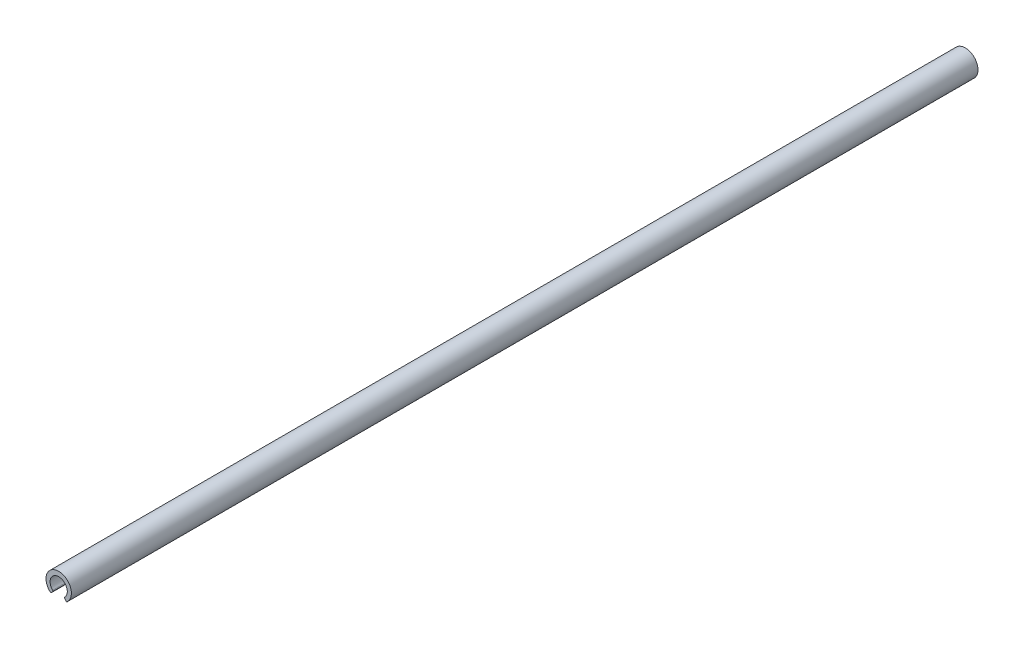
ISO-10303-21;
HEADER;
FILE_DESCRIPTION(('STEP AP214'),'2;1');
FILE_NAME('part.step','',(''),(''),'','','');
FILE_SCHEMA(('AUTOMOTIVE_DESIGN { 1 0 10303 214 1 1 1 1 }'));
ENDSEC;
DATA;
#1=APPLICATION_CONTEXT('core data for automotive mechanical design processes');
#2=APPLICATION_PROTOCOL_DEFINITION('international standard','automotive_design',2000,#1);
#3=PRODUCT_CONTEXT('',#1,'mechanical');
#4=PRODUCT('Part','Part','',(#3));
#5=PRODUCT_RELATED_PRODUCT_CATEGORY('part','',(#4));
#6=PRODUCT_DEFINITION_FORMATION('','',#4);
#7=PRODUCT_DEFINITION_CONTEXT('part definition',#1,'design');
#8=PRODUCT_DEFINITION('design','',#6,#7);
#9=PRODUCT_DEFINITION_SHAPE('','',#8);
#10=(LENGTH_UNIT() NAMED_UNIT(*) SI_UNIT(.MILLI.,.METRE.));
#11=(NAMED_UNIT(*) PLANE_ANGLE_UNIT() SI_UNIT($,.RADIAN.));
#12=(NAMED_UNIT(*) SI_UNIT($,.STERADIAN.) SOLID_ANGLE_UNIT());
#13=UNCERTAINTY_MEASURE_WITH_UNIT(LENGTH_MEASURE(1.E-05),#10,'distance_accuracy_value','');
#14=(GEOMETRIC_REPRESENTATION_CONTEXT(3) GLOBAL_UNCERTAINTY_ASSIGNED_CONTEXT((#13)) GLOBAL_UNIT_ASSIGNED_CONTEXT((#10,
#11,#12)) REPRESENTATION_CONTEXT('',''));
#15=CARTESIAN_POINT('',(0.,0.,0.));
#16=DIRECTION('',(0.,0.,1.));
#17=DIRECTION('',(1.,0.,0.));
#18=AXIS2_PLACEMENT_3D('',#15,#16,#17);
#19=CARTESIAN_POINT('',(-3.69335203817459,-3.73117283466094,500.));
#20=DIRECTION('',(0.,0.,-1.));
#21=DIRECTION('',(-1.,0.,0.));
#22=AXIS2_PLACEMENT_3D('',#19,#20,#21);
#23=CYLINDRICAL_SURFACE('',#22,0.5);
#24=CARTESIAN_POINT('',(-3.69335203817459,-3.73117283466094,0.));
#25=DIRECTION('',(0.,0.,1.));
#26=DIRECTION('',(1.,0.,0.));
#27=AXIS2_PLACEMENT_3D('',#24,#25,#26);
#28=CIRCLE('',#27,0.5);
#29=CARTESIAN_POINT('',(-3.3103298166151,-4.05256663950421,0.));
#30=VERTEX_POINT('',#29);
#31=CARTESIAN_POINT('',(-3.34160422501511,-3.3758230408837,0.));
#32=VERTEX_POINT('',#31);
#33=EDGE_CURVE('E110',#30,#32,#28,.T.);
#34=ORIENTED_EDGE('',*,*,#33,.T.);
#35=DIRECTION('',(0.,0.,-1.));
#36=VECTOR('',#35,1.);
#37=CARTESIAN_POINT('',(-3.34160422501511,-3.3758230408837,500.));
#38=LINE('',#37,#36);
#39=CARTESIAN_POINT('',(-3.34160422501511,-3.3758230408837,500.));
#40=VERTEX_POINT('',#39);
#41=EDGE_CURVE('E9',#40,#32,#38,.T.);
#42=ORIENTED_EDGE('',*,*,#41,.F.);
#43=CARTESIAN_POINT('',(-3.69335203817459,-3.73117283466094,500.));
#44=DIRECTION('',(0.,0.,1.));
#45=DIRECTION('',(1.,0.,0.));
#46=AXIS2_PLACEMENT_3D('',#43,#44,#45);
#47=CIRCLE('',#46,0.5);
#48=CARTESIAN_POINT('',(-3.3103298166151,-4.05256663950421,500.));
#49=VERTEX_POINT('',#48);
#50=EDGE_CURVE('E124',#49,#40,#47,.T.);
#51=ORIENTED_EDGE('',*,*,#50,.F.);
#52=DIRECTION('',(0.,0.,-1.));
#53=VECTOR('',#52,1.);
#54=CARTESIAN_POINT('',(-3.3103298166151,-4.05256663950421,500.));
#55=LINE('',#54,#53);
#56=EDGE_CURVE('E106',#49,#30,#55,.T.);
#57=ORIENTED_EDGE('',*,*,#56,.T.);
#58=EDGE_LOOP('',(#34,#42,#51,#57));
#59=FACE_BOUND('',#58,.T.);
#60=ADVANCED_FACE('F14',(#59),#23,.T.);
#61=CARTESIAN_POINT('',(0.,0.,500.));
#62=DIRECTION('',(0.,0.,-1.));
#63=DIRECTION('',(-1.,0.,0.));
#64=AXIS2_PLACEMENT_3D('',#61,#62,#63);
#65=CYLINDRICAL_SURFACE('',#64,4.75);
#66=CARTESIAN_POINT('',(0.,0.,0.));
#67=DIRECTION('',(0.,0.,-1.));
#68=DIRECTION('',(1.,0.,0.));
#69=AXIS2_PLACEMENT_3D('',#66,#67,#68);
#70=CIRCLE('',#69,4.75);
#71=CARTESIAN_POINT('',(3.34160422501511,-3.3758230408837,0.));
#72=VERTEX_POINT('',#71);
#73=EDGE_CURVE('E113',#32,#72,#70,.T.);
#74=ORIENTED_EDGE('',*,*,#73,.T.);
#75=DIRECTION('',(0.,0.,-1.));
#76=VECTOR('',#75,1.);
#77=CARTESIAN_POINT('',(3.34160422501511,-3.3758230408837,500.));
#78=LINE('',#77,#76);
#79=CARTESIAN_POINT('',(3.34160422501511,-3.3758230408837,500.));
#80=VERTEX_POINT('',#79);
#81=EDGE_CURVE('E22',#80,#72,#78,.T.);
#82=ORIENTED_EDGE('',*,*,#81,.F.);
#83=CARTESIAN_POINT('',(0.,0.,500.));
#84=DIRECTION('',(0.,0.,-1.));
#85=DIRECTION('',(1.,0.,0.));
#86=AXIS2_PLACEMENT_3D('',#83,#84,#85);
#87=CIRCLE('',#86,4.75);
#88=EDGE_CURVE('E73',#40,#80,#87,.T.);
#89=ORIENTED_EDGE('',*,*,#88,.F.);
#90=ORIENTED_EDGE('',*,*,#41,.T.);
#91=EDGE_LOOP('',(#74,#82,#89,#90));
#92=FACE_BOUND('',#91,.T.);
#93=ADVANCED_FACE('F159',(#92),#65,.F.);
#94=CARTESIAN_POINT('',(3.69335203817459,-3.73117283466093,500.));
#95=DIRECTION('',(0.,0.,-1.));
#96=DIRECTION('',(-1.,0.,0.));
#97=AXIS2_PLACEMENT_3D('',#94,#95,#96);
#98=CYLINDRICAL_SURFACE('',#97,0.5);
#99=CARTESIAN_POINT('',(3.69335203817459,-3.73117283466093,0.));
#100=DIRECTION('',(0.,0.,1.));
#101=DIRECTION('',(1.,0.,0.));
#102=AXIS2_PLACEMENT_3D('',#99,#100,#101);
#103=CIRCLE('',#102,0.5);
#104=CARTESIAN_POINT('',(3.31032981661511,-4.0525666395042,0.));
#105=VERTEX_POINT('',#104);
#106=EDGE_CURVE('E115',#72,#105,#103,.T.);
#107=ORIENTED_EDGE('',*,*,#106,.T.);
#108=DIRECTION('',(0.,0.,-1.));
#109=VECTOR('',#108,1.);
#110=CARTESIAN_POINT('',(3.31032981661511,-4.0525666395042,500.));
#111=LINE('',#110,#109);
#112=CARTESIAN_POINT('',(3.31032981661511,-4.0525666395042,500.));
#113=VERTEX_POINT('',#112);
#114=EDGE_CURVE('E131',#113,#105,#111,.T.);
#115=ORIENTED_EDGE('',*,*,#114,.F.);
#116=CARTESIAN_POINT('',(3.69335203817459,-3.73117283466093,500.));
#117=DIRECTION('',(0.,0.,1.));
#118=DIRECTION('',(1.,0.,0.));
#119=AXIS2_PLACEMENT_3D('',#116,#117,#118);
#120=CIRCLE('',#119,0.5);
#121=EDGE_CURVE('E139',#80,#113,#120,.T.);
#122=ORIENTED_EDGE('',*,*,#121,.F.);
#123=ORIENTED_EDGE('',*,*,#81,.T.);
#124=EDGE_LOOP('',(#107,#115,#122,#123));
#125=FACE_BOUND('',#124,.T.);
#126=ADVANCED_FACE('F137',(#125),#98,.T.);
#127=CARTESIAN_POINT('',(3.97467636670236,-4.84430402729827,500.));
#128=DIRECTION('',(0.766044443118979,0.642787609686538,0.));
#129=DIRECTION('',(-0.642787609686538,0.766044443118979,0.));
#130=AXIS2_PLACEMENT_3D('',#127,#128,#129);
#131=PLANE('',#130);
#132=DIRECTION('',(0.642787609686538,-0.766044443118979,0.));
#133=VECTOR('',#132,1.);
#134=CARTESIAN_POINT('',(3.97467636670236,-4.84430402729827,0.));
#135=LINE('',#134,#133);
#136=CARTESIAN_POINT('',(3.97467636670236,-4.84430402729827,0.));
#137=VERTEX_POINT('',#136);
#138=EDGE_CURVE('E117',#105,#137,#135,.T.);
#139=ORIENTED_EDGE('',*,*,#138,.T.);
#140=DIRECTION('',(0.,0.,-1.));
#141=VECTOR('',#140,1.);
#142=CARTESIAN_POINT('',(3.97467636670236,-4.84430402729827,500.));
#143=LINE('',#142,#141);
#144=CARTESIAN_POINT('',(3.97467636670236,-4.84430402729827,500.));
#145=VERTEX_POINT('',#144);
#146=EDGE_CURVE('E128',#145,#137,#143,.T.);
#147=ORIENTED_EDGE('',*,*,#146,.F.);
#148=DIRECTION('',(0.642787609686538,-0.766044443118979,0.));
#149=VECTOR('',#148,1.);
#150=CARTESIAN_POINT('',(3.97467636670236,-4.84430402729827,500.));
#151=LINE('',#150,#149);
#152=EDGE_CURVE('E151',#113,#145,#151,.T.);
#153=ORIENTED_EDGE('',*,*,#152,.F.);
#154=ORIENTED_EDGE('',*,*,#114,.T.);
#155=EDGE_LOOP('',(#139,#147,#153,#154));
#156=FACE_BOUND('',#155,.T.);
#157=ADVANCED_FACE('F147',(#156),#131,.F.);
#158=CARTESIAN_POINT('',(4.35769858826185,-4.522910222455,500.));
#159=DIRECTION('',(0.,0.,-1.));
#160=DIRECTION('',(-1.,0.,0.));
#161=AXIS2_PLACEMENT_3D('',#158,#159,#160);
#162=CYLINDRICAL_SURFACE('',#161,0.5);
#163=CARTESIAN_POINT('',(4.35769858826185,-4.522910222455,0.));
#164=DIRECTION('',(0.,0.,1.));
#165=DIRECTION('',(1.,0.,0.));
#166=AXIS2_PLACEMENT_3D('',#163,#164,#165);
#167=CIRCLE('',#166,0.5);
#168=CARTESIAN_POINT('',(4.69290617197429,-4.89390331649,0.));
#169=VERTEX_POINT('',#168);
#170=EDGE_CURVE('E119',#137,#169,#167,.T.);
#171=ORIENTED_EDGE('',*,*,#170,.T.);
#172=DIRECTION('',(0.,0.,-1.));
#173=VECTOR('',#172,1.);
#174=CARTESIAN_POINT('',(4.69290617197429,-4.89390331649,500.));
#175=LINE('',#174,#173);
#176=CARTESIAN_POINT('',(4.69290617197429,-4.89390331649,500.));
#177=VERTEX_POINT('',#176);
#178=EDGE_CURVE('E101',#177,#169,#175,.T.);
#179=ORIENTED_EDGE('',*,*,#178,.F.);
#180=CARTESIAN_POINT('',(4.35769858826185,-4.522910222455,500.));
#181=DIRECTION('',(0.,0.,1.));
#182=DIRECTION('',(1.,0.,0.));
#183=AXIS2_PLACEMENT_3D('',#180,#181,#182);
#184=CIRCLE('',#183,0.5);
#185=EDGE_CURVE('E92',#145,#177,#184,.T.);
#186=ORIENTED_EDGE('',*,*,#185,.F.);
#187=ORIENTED_EDGE('',*,*,#146,.T.);
#188=EDGE_LOOP('',(#171,#179,#186,#187));
#189=FACE_BOUND('',#188,.T.);
#190=ADVANCED_FACE('F150',(#189),#162,.T.);
#191=CARTESIAN_POINT('',(0.,0.299999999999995,500.));
#192=DIRECTION('',(0.,0.,-1.));
#193=DIRECTION('',(-1.,0.,0.));
#194=AXIS2_PLACEMENT_3D('',#191,#192,#193);
#195=CYLINDRICAL_SURFACE('',#194,7.);
#196=CARTESIAN_POINT('',(0.,0.299999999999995,0.));
#197=DIRECTION('',(0.,0.,1.));
#198=DIRECTION('',(1.,0.,0.));
#199=AXIS2_PLACEMENT_3D('',#196,#197,#198);
#200=CIRCLE('',#199,7.);
#201=CARTESIAN_POINT('',(-4.69290617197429,-4.89390331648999,0.));
#202=VERTEX_POINT('',#201);
#203=EDGE_CURVE('E100',#169,#202,#200,.T.);
#204=ORIENTED_EDGE('',*,*,#203,.T.);
#205=DIRECTION('',(0.,0.,-1.));
#206=VECTOR('',#205,1.);
#207=CARTESIAN_POINT('',(-4.69290617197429,-4.89390331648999,500.));
#208=LINE('',#207,#206);
#209=CARTESIAN_POINT('',(-4.69290617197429,-4.89390331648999,500.));
#210=VERTEX_POINT('',#209);
#211=EDGE_CURVE('E97',#210,#202,#208,.T.);
#212=ORIENTED_EDGE('',*,*,#211,.F.);
#213=CARTESIAN_POINT('',(0.,0.299999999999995,500.));
#214=DIRECTION('',(0.,0.,1.));
#215=DIRECTION('',(1.,0.,0.));
#216=AXIS2_PLACEMENT_3D('',#213,#214,#215);
#217=CIRCLE('',#216,7.);
#218=EDGE_CURVE('E86',#177,#210,#217,.T.);
#219=ORIENTED_EDGE('',*,*,#218,.F.);
#220=ORIENTED_EDGE('',*,*,#178,.T.);
#221=EDGE_LOOP('',(#204,#212,#219,#220));
#222=FACE_BOUND('',#221,.T.);
#223=ADVANCED_FACE('F98',(#222),#195,.T.);
#224=CARTESIAN_POINT('',(-4.35769858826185,-4.522910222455,500.));
#225=DIRECTION('',(0.,0.,-1.));
#226=DIRECTION('',(-1.,0.,0.));
#227=AXIS2_PLACEMENT_3D('',#224,#225,#226);
#228=CYLINDRICAL_SURFACE('',#227,0.5);
#229=CARTESIAN_POINT('',(-4.35769858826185,-4.522910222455,0.));
#230=DIRECTION('',(0.,0.,1.));
#231=DIRECTION('',(1.,0.,0.));
#232=AXIS2_PLACEMENT_3D('',#229,#230,#231);
#233=CIRCLE('',#232,0.5);
#234=CARTESIAN_POINT('',(-3.97467636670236,-4.84430402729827,0.));
#235=VERTEX_POINT('',#234);
#236=EDGE_CURVE('E59',#202,#235,#233,.T.);
#237=ORIENTED_EDGE('',*,*,#236,.T.);
#238=DIRECTION('',(0.,0.,-1.));
#239=VECTOR('',#238,1.);
#240=CARTESIAN_POINT('',(-3.97467636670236,-4.84430402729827,500.));
#241=LINE('',#240,#239);
#242=CARTESIAN_POINT('',(-3.97467636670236,-4.84430402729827,500.));
#243=VERTEX_POINT('',#242);
#244=EDGE_CURVE('E102',#243,#235,#241,.T.);
#245=ORIENTED_EDGE('',*,*,#244,.F.);
#246=CARTESIAN_POINT('',(-4.35769858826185,-4.522910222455,500.));
#247=DIRECTION('',(0.,0.,1.));
#248=DIRECTION('',(1.,0.,0.));
#249=AXIS2_PLACEMENT_3D('',#246,#247,#248);
#250=CIRCLE('',#249,0.5);
#251=EDGE_CURVE('E90',#210,#243,#250,.T.);
#252=ORIENTED_EDGE('',*,*,#251,.F.);
#253=ORIENTED_EDGE('',*,*,#211,.T.);
#254=EDGE_LOOP('',(#237,#245,#252,#253));
#255=FACE_BOUND('',#254,.T.);
#256=ADVANCED_FACE('F104',(#255),#228,.T.);
#257=CARTESIAN_POINT('',(-3.3103298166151,-4.05256663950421,500.));
#258=DIRECTION('',(-0.766044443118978,0.642787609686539,0.));
#259=DIRECTION('',(-0.642787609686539,-0.766044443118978,0.));
#260=AXIS2_PLACEMENT_3D('',#257,#258,#259);
#261=PLANE('',#260);
#262=DIRECTION('',(0.642787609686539,0.766044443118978,0.));
#263=VECTOR('',#262,1.);
#264=CARTESIAN_POINT('',(-3.3103298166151,-4.05256663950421,0.));
#265=LINE('',#264,#263);
#266=EDGE_CURVE('E65',#235,#30,#265,.T.);
#267=ORIENTED_EDGE('',*,*,#266,.T.);
#268=ORIENTED_EDGE('',*,*,#56,.F.);
#269=DIRECTION('',(0.642787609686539,0.766044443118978,0.));
#270=VECTOR('',#269,1.);
#271=CARTESIAN_POINT('',(-3.3103298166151,-4.05256663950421,500.));
#272=LINE('',#271,#270);
#273=EDGE_CURVE('E30',#243,#49,#272,.T.);
#274=ORIENTED_EDGE('',*,*,#273,.F.);
#275=ORIENTED_EDGE('',*,*,#244,.T.);
#276=EDGE_LOOP('',(#267,#268,#274,#275));
#277=FACE_BOUND('',#276,.T.);
#278=ADVANCED_FACE('F176',(#277),#261,.F.);
#279=CARTESIAN_POINT('',(-3.69335203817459,-3.73117283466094,500.));
#280=DIRECTION('',(0.,0.,1.));
#281=DIRECTION('',(1.,0.,0.));
#282=AXIS2_PLACEMENT_3D('',#279,#280,#281);
#283=PLANE('',#282);
#284=ORIENTED_EDGE('',*,*,#50,.T.);
#285=ORIENTED_EDGE('',*,*,#88,.T.);
#286=ORIENTED_EDGE('',*,*,#121,.T.);
#287=ORIENTED_EDGE('',*,*,#152,.T.);
#288=ORIENTED_EDGE('',*,*,#185,.T.);
#289=ORIENTED_EDGE('',*,*,#218,.T.);
#290=ORIENTED_EDGE('',*,*,#251,.T.);
#291=ORIENTED_EDGE('',*,*,#273,.T.);
#292=EDGE_LOOP('',(#284,#285,#286,#287,#288,#289,#290,#291));
#293=FACE_BOUND('',#292,.T.);
#294=ADVANCED_FACE('F88',(#293),#283,.T.);
#295=CARTESIAN_POINT('',(-3.69335203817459,-3.73117283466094,0.));
#296=DIRECTION('',(0.,0.,1.));
#297=DIRECTION('',(1.,0.,0.));
#298=AXIS2_PLACEMENT_3D('',#295,#296,#297);
#299=PLANE('',#298);
#300=ORIENTED_EDGE('',*,*,#33,.F.);
#301=ORIENTED_EDGE('',*,*,#266,.F.);
#302=ORIENTED_EDGE('',*,*,#236,.F.);
#303=ORIENTED_EDGE('',*,*,#203,.F.);
#304=ORIENTED_EDGE('',*,*,#170,.F.);
#305=ORIENTED_EDGE('',*,*,#138,.F.);
#306=ORIENTED_EDGE('',*,*,#106,.F.);
#307=ORIENTED_EDGE('',*,*,#73,.F.);
#308=EDGE_LOOP('',(#300,#301,#302,#303,#304,#305,#306,#307));
#309=FACE_BOUND('',#308,.T.);
#310=ADVANCED_FACE('F143',(#309),#299,.F.);
#311=CLOSED_SHELL('',(#60,#93,#126,#157,#190,#223,#256,#278,#294,#310));
#312=MANIFOLD_SOLID_BREP('B1',#311);
#313=ADVANCED_BREP_SHAPE_REPRESENTATION('',(#18,#312),#14);
#314=SHAPE_DEFINITION_REPRESENTATION(#9,#313);
ENDSEC;
END-ISO-10303-21;
